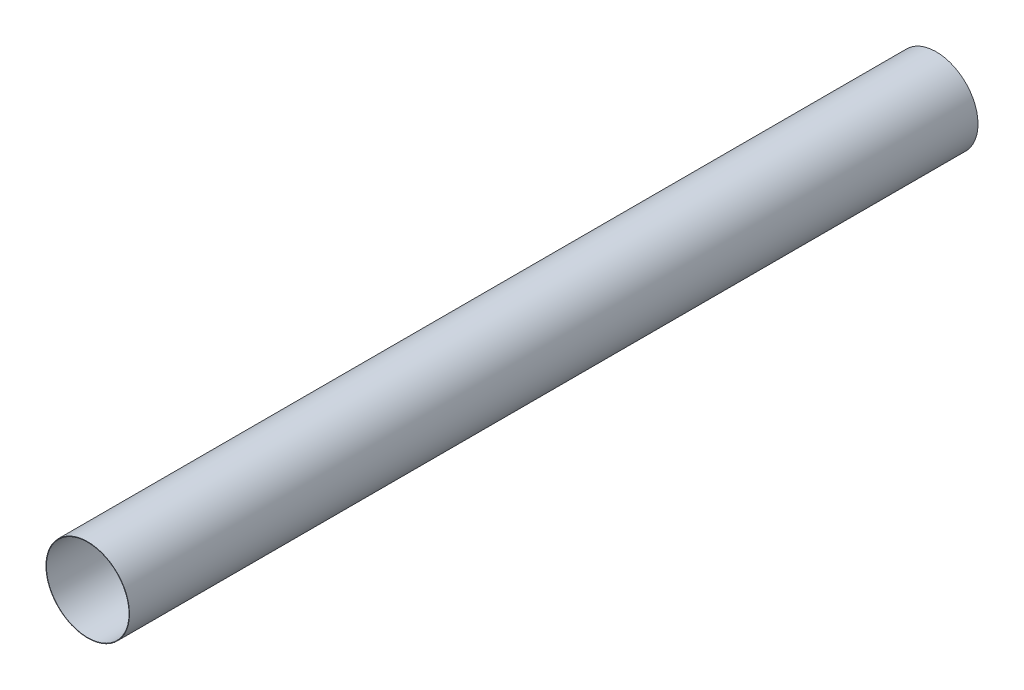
from build123d import *

# Parameters (mm, degrees)
SKETCH1_R           = 19.2
SKETCH1_R_2         = 19
BOSS_EXTRUDE1_DEPTH = 390


with BuildPart() as part:
    # Sketch1 → Boss-Extrude1 (new body)
    with BuildSketch(Plane.XY):
        Circle(SKETCH1_R)
        Circle(SKETCH1_R_2, mode=Mode.SUBTRACT)
    extrude(amount=-BOSS_EXTRUDE1_DEPTH)


solid = part.part
